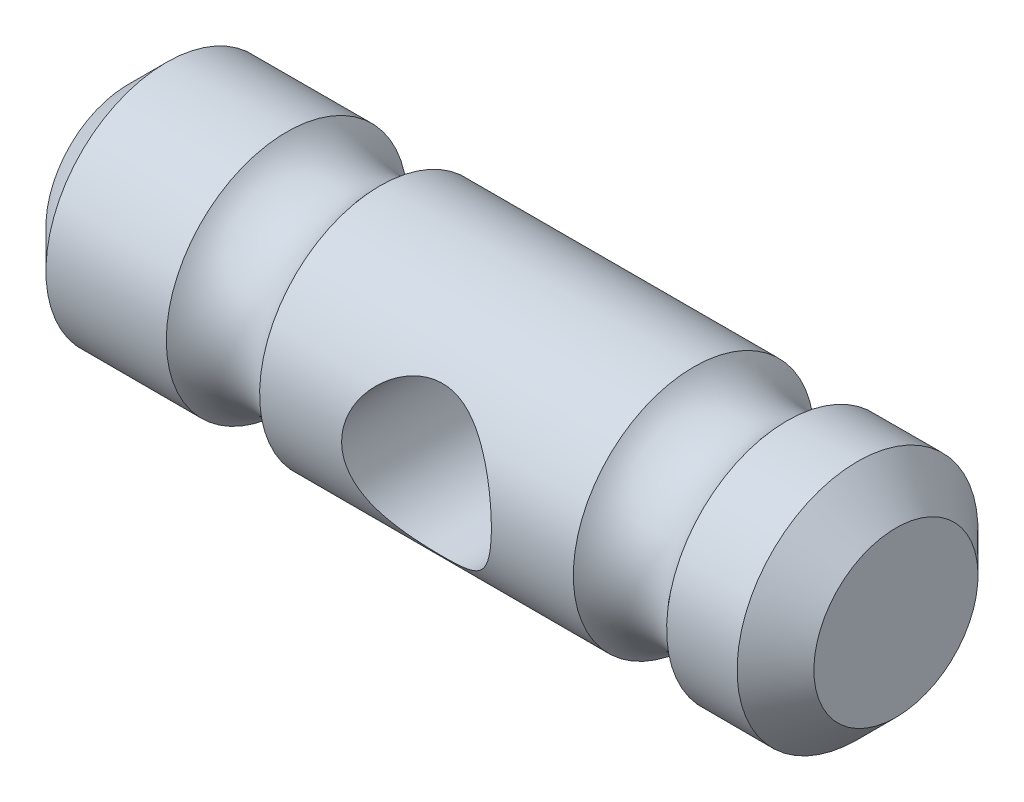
ISO-10303-21;
HEADER;
FILE_DESCRIPTION(('STEP AP214'),'2;1');
FILE_NAME('part.step','',(''),(''),'','','');
FILE_SCHEMA(('AUTOMOTIVE_DESIGN { 1 0 10303 214 1 1 1 1 }'));
ENDSEC;
DATA;
#1=APPLICATION_CONTEXT('core data for automotive mechanical design processes');
#2=APPLICATION_PROTOCOL_DEFINITION('international standard','automotive_design',2000,#1);
#3=PRODUCT_CONTEXT('',#1,'mechanical');
#4=PRODUCT('Part','Part','',(#3));
#5=PRODUCT_RELATED_PRODUCT_CATEGORY('part','',(#4));
#6=PRODUCT_DEFINITION_FORMATION('','',#4);
#7=PRODUCT_DEFINITION_CONTEXT('part definition',#1,'design');
#8=PRODUCT_DEFINITION('design','',#6,#7);
#9=PRODUCT_DEFINITION_SHAPE('','',#8);
#10=(LENGTH_UNIT() NAMED_UNIT(*) SI_UNIT(.MILLI.,.METRE.));
#11=(NAMED_UNIT(*) PLANE_ANGLE_UNIT() SI_UNIT($,.RADIAN.));
#12=(NAMED_UNIT(*) SI_UNIT($,.STERADIAN.) SOLID_ANGLE_UNIT());
#13=UNCERTAINTY_MEASURE_WITH_UNIT(LENGTH_MEASURE(1.E-05),#10,'distance_accuracy_value','');
#14=(GEOMETRIC_REPRESENTATION_CONTEXT(3) GLOBAL_UNCERTAINTY_ASSIGNED_CONTEXT((#13)) GLOBAL_UNIT_ASSIGNED_CONTEXT((#10,
#11,#12)) REPRESENTATION_CONTEXT('',''));
#15=CARTESIAN_POINT('',(0.,0.,0.));
#16=DIRECTION('',(0.,0.,1.));
#17=DIRECTION('',(1.,0.,0.));
#18=AXIS2_PLACEMENT_3D('',#15,#16,#17);
#19=CARTESIAN_POINT('',(0.,0.542925,0.));
#20=DIRECTION('',(1.,0.,0.));
#21=DIRECTION('',(0.,0.,-1.));
#22=AXIS2_PLACEMENT_3D('',#19,#20,#21);
#23=PLANE('',#22);
#24=CARTESIAN_POINT('',(2.27373783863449E-10,0.,0.));
#25=DIRECTION('',(-1.,0.,0.));
#26=DIRECTION('',(0.,-1.,0.));
#27=AXIS2_PLACEMENT_3D('',#24,#25,#26);
#28=CIRCLE('',#27,1.08585000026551);
#29=CARTESIAN_POINT('',(2.27373931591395E-10,-1.08585000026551,0.));
#30=VERTEX_POINT('',#29);
#31=EDGE_CURVE('E18',#30,#30,#28,.T.);
#32=ORIENTED_EDGE('',*,*,#31,.F.);
#33=EDGE_LOOP('',(#32));
#34=FACE_BOUND('',#33,.T.);
#35=ADVANCED_FACE('F15',(#34),#23,.T.);
#36=CARTESIAN_POINT('',(-10.16,0.542925,0.));
#37=DIRECTION('',(-1.,0.,0.));
#38=DIRECTION('',(0.,0.,1.));
#39=AXIS2_PLACEMENT_3D('',#36,#37,#38);
#40=PLANE('',#39);
#41=CARTESIAN_POINT('',(-10.1600000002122,0.,0.));
#42=DIRECTION('',(1.,0.,0.));
#43=DIRECTION('',(0.,0.,-1.));
#44=AXIS2_PLACEMENT_3D('',#41,#42,#43);
#45=CIRCLE('',#44,1.08585000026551);
#46=CARTESIAN_POINT('',(-10.1600000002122,0.,-1.08585000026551));
#47=VERTEX_POINT('',#46);
#48=EDGE_CURVE('E67',#47,#47,#45,.T.);
#49=ORIENTED_EDGE('',*,*,#48,.F.);
#50=EDGE_LOOP('',(#49));
#51=FACE_BOUND('',#50,.T.);
#52=ADVANCED_FACE('F81',(#51),#40,.T.);
#53=CARTESIAN_POINT('',(-0.508000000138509,0.,0.));
#54=DIRECTION('',(-1.,0.,0.));
#55=DIRECTION('',(0.,-1.,0.));
#56=AXIS2_PLACEMENT_3D('',#53,#54,#55);
#57=CONICAL_SURFACE('',#56,1.5938499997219,0.785398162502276);
#58=CARTESIAN_POINT('',(-0.508,0.,0.));
#59=DIRECTION('',(1.,0.,0.));
#60=DIRECTION('',(0.,1.,0.));
#61=AXIS2_PLACEMENT_3D('',#58,#59,#60);
#62=CIRCLE('',#61,1.59385);
#63=CARTESIAN_POINT('',(-0.508,1.59385,0.));
#64=VERTEX_POINT('',#63);
#65=EDGE_CURVE('E69',#64,#64,#62,.F.);
#66=ORIENTED_EDGE('',*,*,#65,.F.);
#67=EDGE_LOOP('',(#66));
#68=FACE_BOUND('',#67,.T.);
#69=ORIENTED_EDGE('',*,*,#31,.T.);
#70=EDGE_LOOP('',(#69));
#71=FACE_BOUND('',#70,.T.);
#72=ADVANCED_FACE('F78',(#68,#71),#57,.T.);
#73=CARTESIAN_POINT('',(-9.6519999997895,0.,0.));
#74=DIRECTION('',(1.,0.,0.));
#75=DIRECTION('',(0.,0.,-1.));
#76=AXIS2_PLACEMENT_3D('',#73,#74,#75);
#77=CONICAL_SURFACE('',#76,1.59384999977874,0.785398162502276);
#78=ORIENTED_EDGE('',*,*,#48,.T.);
#79=EDGE_LOOP('',(#78));
#80=FACE_BOUND('',#79,.T.);
#81=CARTESIAN_POINT('',(-9.652,0.,0.));
#82=DIRECTION('',(1.,0.,0.));
#83=DIRECTION('',(0.,1.,0.));
#84=AXIS2_PLACEMENT_3D('',#81,#82,#83);
#85=CIRCLE('',#84,1.59385);
#86=CARTESIAN_POINT('',(-9.652,1.59385,0.));
#87=VERTEX_POINT('',#86);
#88=EDGE_CURVE('E73',#87,#87,#85,.T.);
#89=ORIENTED_EDGE('',*,*,#88,.F.);
#90=EDGE_LOOP('',(#89));
#91=FACE_BOUND('',#90,.T.);
#92=ADVANCED_FACE('F119',(#80,#91),#77,.T.);
#93=CARTESIAN_POINT('',(-0.97410371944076,0.,0.));
#94=DIRECTION('',(1.,0.,0.));
#95=DIRECTION('',(0.,1.,0.));
#96=AXIS2_PLACEMENT_3D('',#93,#94,#95);
#97=CYLINDRICAL_SURFACE('',#96,1.59385);
#98=CARTESIAN_POINT('',(-1.44020743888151,0.,0.));
#99=DIRECTION('',(1.,0.,0.));
#100=DIRECTION('',(0.,0.,-1.));
#101=AXIS2_PLACEMENT_3D('',#98,#99,#100);
#102=CIRCLE('',#101,1.59385);
#103=CARTESIAN_POINT('',(-1.44020743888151,0.,-1.59385));
#104=VERTEX_POINT('',#103);
#105=EDGE_CURVE('E102',#104,#104,#102,.T.);
#106=ORIENTED_EDGE('',*,*,#105,.T.);
#107=EDGE_LOOP('',(#106));
#108=FACE_BOUND('',#107,.T.);
#109=ORIENTED_EDGE('',*,*,#65,.T.);
#110=EDGE_LOOP('',(#109));
#111=FACE_BOUND('',#110,.T.);
#112=ADVANCED_FACE('F121',(#108,#111),#97,.T.);
#113=CARTESIAN_POINT('',(-8.85569628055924,0.,0.));
#114=DIRECTION('',(1.,0.,0.));
#115=DIRECTION('',(0.,1.,0.));
#116=AXIS2_PLACEMENT_3D('',#113,#114,#115);
#117=CYLINDRICAL_SURFACE('',#116,1.59385);
#118=ORIENTED_EDGE('',*,*,#88,.T.);
#119=EDGE_LOOP('',(#118));
#120=FACE_BOUND('',#119,.T.);
#121=CARTESIAN_POINT('',(-8.05939256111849,0.,0.));
#122=DIRECTION('',(1.,0.,0.));
#123=DIRECTION('',(0.,0.,-1.));
#124=AXIS2_PLACEMENT_3D('',#121,#122,#123);
#125=CIRCLE('',#124,1.59385);
#126=CARTESIAN_POINT('',(-8.05939256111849,0.,-1.59385));
#127=VERTEX_POINT('',#126);
#128=EDGE_CURVE('E35',#127,#127,#125,.F.);
#129=ORIENTED_EDGE('',*,*,#128,.T.);
#130=EDGE_LOOP('',(#129));
#131=FACE_BOUND('',#130,.T.);
#132=ADVANCED_FACE('F99',(#120,#131),#117,.T.);
#133=CARTESIAN_POINT('',(-2.0574,0.,0.));
#134=DIRECTION('',(1.,0.,0.));
#135=DIRECTION('',(0.,0.,-1.));
#136=AXIS2_PLACEMENT_3D('',#133,#134,#135);
#137=TOROIDAL_SURFACE('',#136,2.0828,0.7874);
#138=CARTESIAN_POINT('',(-2.67459256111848,0.,0.));
#139=DIRECTION('',(1.,0.,0.));
#140=DIRECTION('',(0.,1.,0.));
#141=AXIS2_PLACEMENT_3D('',#138,#139,#140);
#142=CIRCLE('',#141,1.59385);
#143=CARTESIAN_POINT('',(-2.67459256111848,1.59385,0.));
#144=VERTEX_POINT('',#143);
#145=EDGE_CURVE('E32',#144,#144,#142,.F.);
#146=ORIENTED_EDGE('',*,*,#145,.F.);
#147=EDGE_LOOP('',(#146));
#148=FACE_BOUND('',#147,.T.);
#149=ORIENTED_EDGE('',*,*,#105,.F.);
#150=EDGE_LOOP('',(#149));
#151=FACE_BOUND('',#150,.T.);
#152=ADVANCED_FACE('F53',(#148,#151),#137,.F.);
#153=CARTESIAN_POINT('',(-4.7498,0.,0.));
#154=DIRECTION('',(0.,0.,1.));
#155=DIRECTION('',(1.,0.,0.));
#156=AXIS2_PLACEMENT_3D('',#153,#154,#155);
#157=CYLINDRICAL_SURFACE('',#156,0.9906);
#158=CARTESIAN_POINT('',(-4.7498,-0.9906,-1.24862703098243));
#159=CARTESIAN_POINT('',(-4.70049975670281,-0.990595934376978,-1.24863340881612));
#160=CARTESIAN_POINT('',(-4.6511194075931,-0.986886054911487,-1.25160128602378));
#161=CARTESIAN_POINT('',(-4.55401445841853,-0.972308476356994,-1.26295395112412));
#162=CARTESIAN_POINT('',(-4.50629485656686,-0.961420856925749,-1.27135381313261));
#163=CARTESIAN_POINT('',(-4.41421149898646,-0.933256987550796,-1.29216471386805));
#164=CARTESIAN_POINT('',(-4.36982276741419,-0.916035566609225,-1.30454121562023));
#165=CARTESIAN_POINT('',(-4.28462127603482,-0.875853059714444,-1.33185147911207));
#166=CARTESIAN_POINT('',(-4.2438085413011,-0.852891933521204,-1.34678525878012));
#167=CARTESIAN_POINT('',(-4.16096992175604,-0.798337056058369,-1.3799141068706));
#168=CARTESIAN_POINT('',(-4.11949957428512,-0.76600265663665,-1.39827913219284));
#169=CARTESIAN_POINT('',(-4.04210133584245,-0.695131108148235,-1.43483212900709));
#170=CARTESIAN_POINT('',(-4.00617823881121,-0.656588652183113,-1.45301993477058));
#171=CARTESIAN_POINT('',(-3.93666606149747,-0.568851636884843,-1.48972625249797));
#172=CARTESIAN_POINT('',(-3.9038613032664,-0.518935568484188,-1.50802734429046));
#173=CARTESIAN_POINT('',(-3.8473781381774,-0.412938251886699,-1.54042185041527));
#174=CARTESIAN_POINT('',(-3.82369078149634,-0.356863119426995,-1.55451938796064));
#175=CARTESIAN_POINT('',(-3.78868319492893,-0.246104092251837,-1.57563995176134));
#176=CARTESIAN_POINT('',(-3.77635705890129,-0.191849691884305,-1.58323283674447));
#177=CARTESIAN_POINT('',(-3.76100063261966,-0.0815704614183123,-1.5927194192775));
#178=CARTESIAN_POINT('',(-3.75796071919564,-0.0255475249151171,-1.59461901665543));
#179=CARTESIAN_POINT('',(-3.76113743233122,0.0786414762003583,-1.59264698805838));
#180=CARTESIAN_POINT('',(-3.76617872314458,0.126863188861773,-1.58950807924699));
#181=CARTESIAN_POINT('',(-3.78311009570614,0.221618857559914,-1.57908649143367));
#182=CARTESIAN_POINT('',(-3.79500069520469,0.268152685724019,-1.57180349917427));
#183=CARTESIAN_POINT('',(-3.82512348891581,0.358524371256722,-1.55368961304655));
#184=CARTESIAN_POINT('',(-3.84337492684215,0.402353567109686,-1.54284795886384));
#185=CARTESIAN_POINT('',(-3.88553767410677,0.486364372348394,-1.51846086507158));
#186=CARTESIAN_POINT('',(-3.90945029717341,0.526545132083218,-1.50491479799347));
#187=CARTESIAN_POINT('',(-3.96557870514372,0.607454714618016,-1.47426308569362));
#188=CARTESIAN_POINT('',(-3.99845589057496,0.64763569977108,-1.45692438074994));
#189=CARTESIAN_POINT('',(-4.06987301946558,0.722260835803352,-1.42141103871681));
#190=CARTESIAN_POINT('',(-4.10842112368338,0.756696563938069,-1.40323522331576));
#191=CARTESIAN_POINT('',(-4.19591564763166,0.82334896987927,-1.36532180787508));
#192=CARTESIAN_POINT('',(-4.24556174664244,0.854711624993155,-1.34568371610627));
#193=CARTESIAN_POINT('',(-4.35061830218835,0.908520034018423,-1.3099603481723));
#194=CARTESIAN_POINT('',(-4.40601787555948,0.930982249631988,-1.29386853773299));
#195=CARTESIAN_POINT('',(-4.50627484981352,0.961230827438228,-1.27147580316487));
#196=CARTESIAN_POINT('',(-4.55011073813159,0.971317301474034,-1.26371571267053));
#197=CARTESIAN_POINT('',(-4.63927995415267,0.985446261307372,-1.25273171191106));
#198=CARTESIAN_POINT('',(-4.68461119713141,0.989496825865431,-1.2495017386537));
#199=CARTESIAN_POINT('',(-4.77557945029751,0.991311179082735,-1.24806326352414));
#200=CARTESIAN_POINT('',(-4.82121690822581,0.989061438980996,-1.24986556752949));
#201=CARTESIAN_POINT('',(-4.9113311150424,0.978395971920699,-1.25822984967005));
#202=CARTESIAN_POINT('',(-4.9558068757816,0.969975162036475,-1.26479575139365));
#203=CARTESIAN_POINT('',(-5.04186842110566,0.947594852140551,-1.28164424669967));
#204=CARTESIAN_POINT('',(-5.08348623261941,0.933715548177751,-1.29187284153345));
#205=CARTESIAN_POINT('',(-5.1639070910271,0.900939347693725,-1.31493990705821));
#206=CARTESIAN_POINT('',(-5.20270912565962,0.882040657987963,-1.32777931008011));
#207=CARTESIAN_POINT('',(-5.28418817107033,0.835650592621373,-1.35754935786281));
#208=CARTESIAN_POINT('',(-5.3262100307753,0.807210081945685,-1.37479450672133));
#209=CARTESIAN_POINT('',(-5.40534468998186,0.744382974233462,-1.40980425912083));
#210=CARTESIAN_POINT('',(-5.44245236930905,0.709990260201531,-1.4275693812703));
#211=CARTESIAN_POINT('',(-5.51658472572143,0.629882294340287,-1.46487125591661));
#212=CARTESIAN_POINT('',(-5.55269509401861,0.583237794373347,-1.48425259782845));
#213=CARTESIAN_POINT('',(-5.61649097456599,0.483362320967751,-1.51971069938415));
#214=CARTESIAN_POINT('',(-5.64418070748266,0.43013466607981,-1.5357891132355));
#215=CARTESIAN_POINT('',(-5.68836614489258,0.321845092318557,-1.56194726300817));
#216=CARTESIAN_POINT('',(-5.70544859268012,0.267100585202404,-1.57233667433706));
#217=CARTESIAN_POINT('',(-5.72991996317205,0.154744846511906,-1.58732751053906));
#218=CARTESIAN_POINT('',(-5.73732194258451,0.097137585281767,-1.59193673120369));
#219=CARTESIAN_POINT('',(-5.74158574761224,-0.0101684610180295,-1.59458735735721));
#220=CARTESIAN_POINT('',(-5.73982580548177,-0.0597969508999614,-1.59348763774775));
#221=CARTESIAN_POINT('',(-5.72897439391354,-0.15792767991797,-1.58676821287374));
#222=CARTESIAN_POINT('',(-5.71988318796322,-0.206429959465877,-1.58114867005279));
#223=CARTESIAN_POINT('',(-5.69524777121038,-0.299432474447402,-1.56615756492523));
#224=CARTESIAN_POINT('',(-5.67991867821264,-0.344011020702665,-1.55691141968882));
#225=CARTESIAN_POINT('',(-5.64345937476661,-0.429931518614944,-1.53540878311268));
#226=CARTESIAN_POINT('',(-5.62232815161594,-0.471272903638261,-1.52315176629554));
#227=CARTESIAN_POINT('',(-5.57241614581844,-0.55423313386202,-1.49509070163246));
#228=CARTESIAN_POINT('',(-5.54306620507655,-0.595428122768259,-1.47904967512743));
#229=CARTESIAN_POINT('',(-5.47877977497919,-0.672609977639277,-1.44558887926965));
#230=CARTESIAN_POINT('',(-5.44383692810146,-0.708590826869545,-1.42816755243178));
#231=CARTESIAN_POINT('',(-5.36361495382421,-0.779605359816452,-1.39082711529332));
#232=CARTESIAN_POINT('',(-5.31757268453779,-0.813779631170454,-1.37090447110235));
#233=CARTESIAN_POINT('',(-5.21959070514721,-0.874004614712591,-1.33331734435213));
#234=CARTESIAN_POINT('',(-5.16765455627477,-0.900060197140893,-1.31565151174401));
#235=CARTESIAN_POINT('',(-5.07081165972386,-0.938253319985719,-1.28858873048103));
#236=CARTESIAN_POINT('',(-5.02688609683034,-0.952193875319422,-1.27822723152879));
#237=CARTESIAN_POINT('',(-4.93682725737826,-0.973877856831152,-1.26178830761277));
#238=CARTESIAN_POINT('',(-4.89070155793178,-0.981641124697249,-1.25569717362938));
#239=CARTESIAN_POINT('',(-4.82847694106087,-0.98759663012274,-1.25100471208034));
#240=CARTESIAN_POINT('',(-4.81277982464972,-0.988721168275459,-1.2501157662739));
#241=CARTESIAN_POINT('',(-4.78132454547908,-0.990223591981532,-1.24892583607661));
#242=CARTESIAN_POINT('',(-4.76556636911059,-0.99060130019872,-1.24862499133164));
#243=CARTESIAN_POINT('',(-4.7498,-0.9906,-1.24862703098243));
#244=B_SPLINE_CURVE_WITH_KNOTS('',3,(#158,#159,#160,#161,#162,#163,#164,#165,#166,#167,#168,
#169,#170,#171,#172,#173,#174,#175,#176,#177,#178,#179,#180,#181,#182,#183,#184,#185,#186,#187,
#188,#189,#190,#191,#192,#193,#194,#195,#196,#197,#198,#199,#200,#201,#202,#203,#204,#205,#206,
#207,#208,#209,#210,#211,#212,#213,#214,#215,#216,#217,#218,#219,#220,#221,#222,#223,#224,#225,
#226,#227,#228,#229,#230,#231,#232,#233,#234,#235,#236,#237,#238,#239,#240,#241,#242,#243),
.UNSPECIFIED.,.T.,.F.,(4,2,2,2,2,2,2,2,2,2,2,2,2,2,2,2,2,2,2,2,2,2,2,2,2,2,2,2,2,2,2,2,2,2,2,2,
2,2,2,2,2,2,4),(0.,0.147828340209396,0.296068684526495,0.443054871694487,0.590042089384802,
0.756501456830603,0.92310388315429,1.10949932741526,1.29571133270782,1.463153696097,
1.63042248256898,1.77548433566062,1.92055715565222,2.06607273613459,2.21162211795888,
2.37518834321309,2.53899229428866,2.72384895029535,2.9083620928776,3.04472588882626,
3.18090700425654,3.31738076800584,3.45396706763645,3.58861741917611,3.72331593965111,
3.88349086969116,4.04383139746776,4.2291617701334,4.41439909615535,4.58817192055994,
4.7617101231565,4.9099707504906,5.05822604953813,5.20175167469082,5.3453023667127,
5.50387799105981,5.66263516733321,5.84392728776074,6.02511044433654,6.16627409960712,
6.30698248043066,6.35424721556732,6.40152317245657),.UNSPECIFIED.);
#245=CARTESIAN_POINT('',(-4.7498,-0.9906,-1.24862703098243));
#246=VERTEX_POINT('',#245);
#247=EDGE_CURVE('E22',#246,#246,#244,.T.);
#248=ORIENTED_EDGE('',*,*,#247,.F.);
#249=EDGE_LOOP('',(#248));
#250=FACE_BOUND('',#249,.T.);
#251=CARTESIAN_POINT('',(-4.7498,-0.9906,1.24862703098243));
#252=CARTESIAN_POINT('',(-4.79910024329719,-0.990595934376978,1.24863340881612));
#253=CARTESIAN_POINT('',(-4.8484805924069,-0.986886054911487,1.25160128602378));
#254=CARTESIAN_POINT('',(-4.94558554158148,-0.972308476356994,1.26295395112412));
#255=CARTESIAN_POINT('',(-4.99330514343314,-0.961420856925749,1.27135381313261));
#256=CARTESIAN_POINT('',(-5.08538850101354,-0.933256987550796,1.29216471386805));
#257=CARTESIAN_POINT('',(-5.12977723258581,-0.916035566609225,1.30454121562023));
#258=CARTESIAN_POINT('',(-5.21497872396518,-0.875853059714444,1.33185147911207));
#259=CARTESIAN_POINT('',(-5.2557914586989,-0.852891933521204,1.34678525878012));
#260=CARTESIAN_POINT('',(-5.33863007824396,-0.798337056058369,1.3799141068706));
#261=CARTESIAN_POINT('',(-5.38010042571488,-0.76600265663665,1.39827913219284));
#262=CARTESIAN_POINT('',(-5.45749866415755,-0.695131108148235,1.43483212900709));
#263=CARTESIAN_POINT('',(-5.49342176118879,-0.656588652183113,1.45301993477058));
#264=CARTESIAN_POINT('',(-5.56293393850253,-0.568851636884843,1.48972625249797));
#265=CARTESIAN_POINT('',(-5.5957386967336,-0.518935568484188,1.50802734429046));
#266=CARTESIAN_POINT('',(-5.6522218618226,-0.4129382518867,1.54042185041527));
#267=CARTESIAN_POINT('',(-5.67590921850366,-0.356863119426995,1.55451938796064));
#268=CARTESIAN_POINT('',(-5.71091680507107,-0.246104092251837,1.57563995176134));
#269=CARTESIAN_POINT('',(-5.72324294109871,-0.191849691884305,1.58323283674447));
#270=CARTESIAN_POINT('',(-5.73859936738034,-0.0815704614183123,1.5927194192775));
#271=CARTESIAN_POINT('',(-5.74163928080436,-0.0255475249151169,1.59461901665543));
#272=CARTESIAN_POINT('',(-5.73846256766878,0.0786414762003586,1.59264698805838));
#273=CARTESIAN_POINT('',(-5.73342127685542,0.126863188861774,1.58950807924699));
#274=CARTESIAN_POINT('',(-5.71648990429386,0.221618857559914,1.57908649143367));
#275=CARTESIAN_POINT('',(-5.70459930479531,0.268152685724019,1.57180349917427));
#276=CARTESIAN_POINT('',(-5.67447651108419,0.358524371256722,1.55368961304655));
#277=CARTESIAN_POINT('',(-5.65622507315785,0.402353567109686,1.54284795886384));
#278=CARTESIAN_POINT('',(-5.61406232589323,0.486364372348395,1.51846086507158));
#279=CARTESIAN_POINT('',(-5.59014970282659,0.526545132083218,1.50491479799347));
#280=CARTESIAN_POINT('',(-5.53402129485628,0.607454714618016,1.47426308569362));
#281=CARTESIAN_POINT('',(-5.50114410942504,0.64763569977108,1.45692438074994));
#282=CARTESIAN_POINT('',(-5.42972698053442,0.722260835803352,1.42141103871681));
#283=CARTESIAN_POINT('',(-5.39117887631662,0.756696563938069,1.40323522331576));
#284=CARTESIAN_POINT('',(-5.30368435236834,0.82334896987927,1.36532180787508));
#285=CARTESIAN_POINT('',(-5.25403825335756,0.854711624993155,1.34568371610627));
#286=CARTESIAN_POINT('',(-5.14898169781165,0.908520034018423,1.3099603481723));
#287=CARTESIAN_POINT('',(-5.09358212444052,0.930982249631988,1.29386853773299));
#288=CARTESIAN_POINT('',(-4.99332515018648,0.961230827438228,1.27147580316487));
#289=CARTESIAN_POINT('',(-4.94948926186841,0.971317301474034,1.26371571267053));
#290=CARTESIAN_POINT('',(-4.86032004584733,0.985446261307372,1.25273171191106));
#291=CARTESIAN_POINT('',(-4.81498880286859,0.989496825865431,1.2495017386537));
#292=CARTESIAN_POINT('',(-4.72402054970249,0.991311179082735,1.24806326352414));
#293=CARTESIAN_POINT('',(-4.67838309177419,0.989061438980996,1.24986556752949));
#294=CARTESIAN_POINT('',(-4.5882688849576,0.978395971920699,1.25822984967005));
#295=CARTESIAN_POINT('',(-4.5437931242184,0.969975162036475,1.26479575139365));
#296=CARTESIAN_POINT('',(-4.45773157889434,0.947594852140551,1.28164424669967));
#297=CARTESIAN_POINT('',(-4.41611376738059,0.933715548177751,1.29187284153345));
#298=CARTESIAN_POINT('',(-4.3356929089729,0.900939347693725,1.31493990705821));
#299=CARTESIAN_POINT('',(-4.29689087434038,0.882040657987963,1.32777931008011));
#300=CARTESIAN_POINT('',(-4.21541182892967,0.835650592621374,1.35754935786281));
#301=CARTESIAN_POINT('',(-4.1733899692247,0.807210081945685,1.37479450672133));
#302=CARTESIAN_POINT('',(-4.09425531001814,0.744382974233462,1.40980425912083));
#303=CARTESIAN_POINT('',(-4.05714763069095,0.709990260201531,1.4275693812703));
#304=CARTESIAN_POINT('',(-3.98301527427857,0.629882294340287,1.46487125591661));
#305=CARTESIAN_POINT('',(-3.94690490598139,0.583237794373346,1.48425259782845));
#306=CARTESIAN_POINT('',(-3.88310902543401,0.483362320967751,1.51971069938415));
#307=CARTESIAN_POINT('',(-3.85541929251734,0.430134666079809,1.5357891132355));
#308=CARTESIAN_POINT('',(-3.81123385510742,0.321845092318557,1.56194726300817));
#309=CARTESIAN_POINT('',(-3.79415140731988,0.267100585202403,1.57233667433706));
#310=CARTESIAN_POINT('',(-3.76968003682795,0.154744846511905,1.58732751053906));
#311=CARTESIAN_POINT('',(-3.76227805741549,0.0971375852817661,1.59193673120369));
#312=CARTESIAN_POINT('',(-3.75801425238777,-0.0101684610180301,1.59458735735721));
#313=CARTESIAN_POINT('',(-3.75977419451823,-0.0597969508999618,1.59348763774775));
#314=CARTESIAN_POINT('',(-3.77062560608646,-0.15792767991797,1.58676821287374));
#315=CARTESIAN_POINT('',(-3.77971681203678,-0.206429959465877,1.58114867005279));
#316=CARTESIAN_POINT('',(-3.80435222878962,-0.299432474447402,1.56615756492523));
#317=CARTESIAN_POINT('',(-3.81968132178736,-0.344011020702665,1.55691141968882));
#318=CARTESIAN_POINT('',(-3.85614062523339,-0.429931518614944,1.53540878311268));
#319=CARTESIAN_POINT('',(-3.87727184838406,-0.471272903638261,1.52315176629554));
#320=CARTESIAN_POINT('',(-3.92718385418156,-0.55423313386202,1.49509070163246));
#321=CARTESIAN_POINT('',(-3.95653379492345,-0.595428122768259,1.47904967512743));
#322=CARTESIAN_POINT('',(-4.02082022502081,-0.672609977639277,1.44558887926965));
#323=CARTESIAN_POINT('',(-4.05576307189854,-0.708590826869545,1.42816755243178));
#324=CARTESIAN_POINT('',(-4.13598504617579,-0.779605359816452,1.39082711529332));
#325=CARTESIAN_POINT('',(-4.18202731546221,-0.813779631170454,1.37090447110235));
#326=CARTESIAN_POINT('',(-4.28000929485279,-0.87400461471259,1.33331734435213));
#327=CARTESIAN_POINT('',(-4.33194544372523,-0.900060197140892,1.31565151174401));
#328=CARTESIAN_POINT('',(-4.42878834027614,-0.938253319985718,1.28858873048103));
#329=CARTESIAN_POINT('',(-4.47271390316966,-0.952193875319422,1.27822723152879));
#330=CARTESIAN_POINT('',(-4.56277274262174,-0.973877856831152,1.26178830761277));
#331=CARTESIAN_POINT('',(-4.60889844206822,-0.981641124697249,1.25569717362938));
#332=CARTESIAN_POINT('',(-4.67112305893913,-0.98759663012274,1.25100471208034));
#333=CARTESIAN_POINT('',(-4.68682017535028,-0.988721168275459,1.2501157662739));
#334=CARTESIAN_POINT('',(-4.71827545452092,-0.990223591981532,1.2489258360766));
#335=CARTESIAN_POINT('',(-4.73403363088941,-0.99060130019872,1.24862499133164));
#336=CARTESIAN_POINT('',(-4.7498,-0.9906,1.24862703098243));
#337=B_SPLINE_CURVE_WITH_KNOTS('',3,(#251,#252,#253,#254,#255,#256,#257,#258,#259,#260,#261,
#262,#263,#264,#265,#266,#267,#268,#269,#270,#271,#272,#273,#274,#275,#276,#277,#278,#279,#280,
#281,#282,#283,#284,#285,#286,#287,#288,#289,#290,#291,#292,#293,#294,#295,#296,#297,#298,#299,
#300,#301,#302,#303,#304,#305,#306,#307,#308,#309,#310,#311,#312,#313,#314,#315,#316,#317,#318,
#319,#320,#321,#322,#323,#324,#325,#326,#327,#328,#329,#330,#331,#332,#333,#334,#335,#336),
.UNSPECIFIED.,.T.,.F.,(4,2,2,2,2,2,2,2,2,2,2,2,2,2,2,2,2,2,2,2,2,2,2,2,2,2,2,2,2,2,2,2,2,2,2,2,
2,2,2,2,2,2,4),(0.,0.147828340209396,0.296068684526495,0.443054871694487,0.590042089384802,
0.756501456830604,0.923103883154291,1.10949932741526,1.29571133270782,1.463153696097,
1.63042248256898,1.77548433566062,1.92055715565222,2.06607273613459,2.21162211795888,
2.37518834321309,2.53899229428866,2.72384895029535,2.9083620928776,3.04472588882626,
3.18090700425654,3.31738076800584,3.45396706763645,3.58861741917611,3.72331593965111,
3.88349086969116,4.04383139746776,4.2291617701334,4.41439909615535,4.58817192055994,
4.7617101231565,4.9099707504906,5.05822604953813,5.20175167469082,5.3453023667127,
5.50387799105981,5.66263516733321,5.84392728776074,6.02511044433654,6.16627409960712,
6.30698248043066,6.35424721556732,6.40152317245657),.UNSPECIFIED.);
#338=CARTESIAN_POINT('',(-4.7498,-0.9906,1.24862703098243));
#339=VERTEX_POINT('',#338);
#340=EDGE_CURVE('E27',#339,#339,#337,.T.);
#341=ORIENTED_EDGE('',*,*,#340,.F.);
#342=EDGE_LOOP('',(#341));
#343=FACE_BOUND('',#342,.T.);
#344=ADVANCED_FACE('F47',(#250,#343),#157,.F.);
#345=CARTESIAN_POINT('',(-7.4422,0.,0.));
#346=DIRECTION('',(1.,0.,0.));
#347=DIRECTION('',(0.,0.,-1.));
#348=AXIS2_PLACEMENT_3D('',#345,#346,#347);
#349=TOROIDAL_SURFACE('',#348,2.0828,0.7874);
#350=ORIENTED_EDGE('',*,*,#128,.F.);
#351=EDGE_LOOP('',(#350));
#352=FACE_BOUND('',#351,.T.);
#353=CARTESIAN_POINT('',(-6.82500743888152,0.,0.));
#354=DIRECTION('',(1.,0.,0.));
#355=DIRECTION('',(0.,1.,0.));
#356=AXIS2_PLACEMENT_3D('',#353,#354,#355);
#357=CIRCLE('',#356,1.59385);
#358=CARTESIAN_POINT('',(-6.82500743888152,1.59385,0.));
#359=VERTEX_POINT('',#358);
#360=EDGE_CURVE('E10',#359,#359,#357,.T.);
#361=ORIENTED_EDGE('',*,*,#360,.F.);
#362=EDGE_LOOP('',(#361));
#363=FACE_BOUND('',#362,.T.);
#364=ADVANCED_FACE('F42',(#352,#363),#349,.F.);
#365=CARTESIAN_POINT('',(-4.7498,0.,0.));
#366=DIRECTION('',(1.,0.,0.));
#367=DIRECTION('',(0.,1.,0.));
#368=AXIS2_PLACEMENT_3D('',#365,#366,#367);
#369=CYLINDRICAL_SURFACE('',#368,1.59385);
#370=ORIENTED_EDGE('',*,*,#360,.T.);
#371=EDGE_LOOP('',(#370));
#372=FACE_BOUND('',#371,.T.);
#373=ORIENTED_EDGE('',*,*,#247,.T.);
#374=EDGE_LOOP('',(#373));
#375=FACE_BOUND('',#374,.T.);
#376=ORIENTED_EDGE('',*,*,#340,.T.);
#377=EDGE_LOOP('',(#376));
#378=FACE_BOUND('',#377,.T.);
#379=ORIENTED_EDGE('',*,*,#145,.T.);
#380=EDGE_LOOP('',(#379));
#381=FACE_BOUND('',#380,.T.);
#382=ADVANCED_FACE('F46',(#372,#375,#378,#381),#369,.T.);
#383=CLOSED_SHELL('',(#35,#52,#72,#92,#112,#132,#152,#344,#364,#382));
#384=MANIFOLD_SOLID_BREP('B1',#383);
#385=ADVANCED_BREP_SHAPE_REPRESENTATION('',(#18,#384),#14);
#386=SHAPE_DEFINITION_REPRESENTATION(#9,#385);
ENDSEC;
END-ISO-10303-21;
